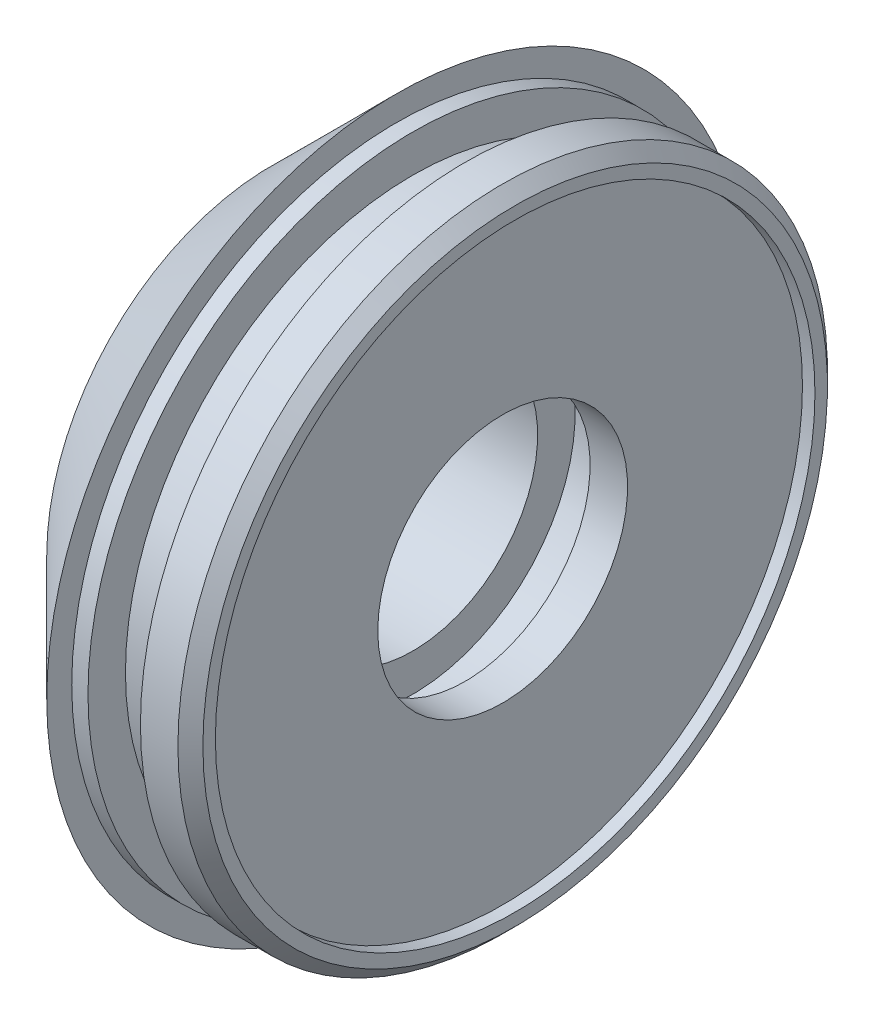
from build123d import *


with BuildPart() as part:
    # Esquisse1 → Base-R_volution (revolve)
    with BuildSketch(Plane.XY, mode=Mode.PRIVATE) as base_r_volution_sk:
        Polygon((0, 5), (0, 9), (5, 14), (5, 13), (5.65, 13), (5.65, 11.5), (7.75, 11.5), (7.75, 13), (9.25, 13), (9.75, 12.5), (9.75, 12), (9.25, 12), (9.25, 5), (7.75, 5), (7.75, 6.5), (5.65, 6.5), (5.65, 5), align=None)
    revolve(base_r_volution_sk.sketch.rotate(Axis((-30, 0, 0), (1, 0, 0)), 90), axis=Axis((-30, 0, 0), (1, 0, 0)))


solid = part.part
